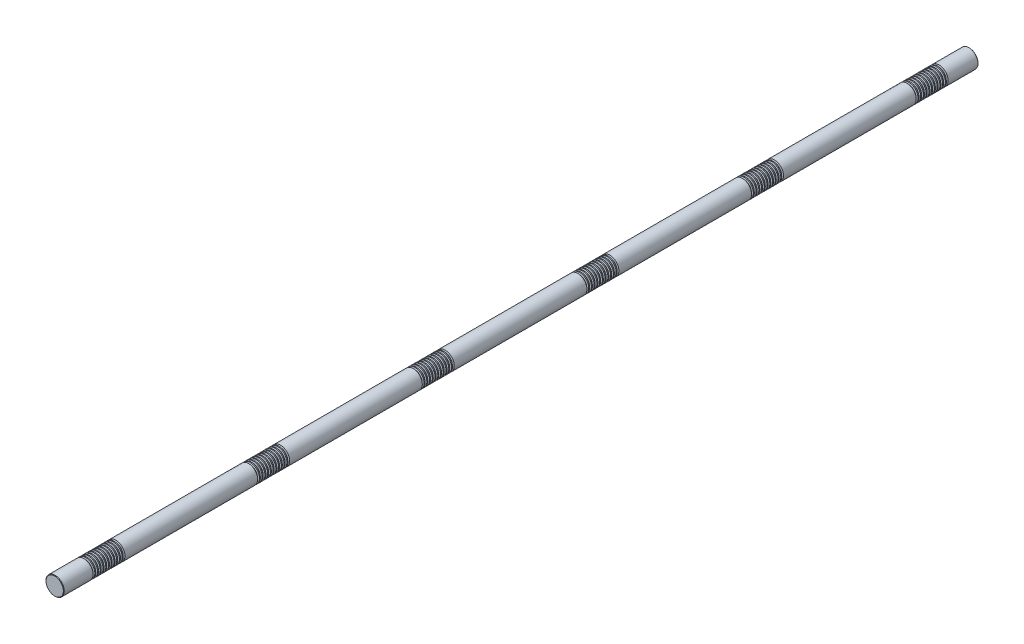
from build123d import *

# Parameters (mm, degrees)
SKETCH1_R           = 30
BOSS_EXTRUDE1_DEPTH = 1500
CHAMFER1_SIZE       = 1.5
LPATTERN1_COUNT     = 12
LPATTERN1_PITCH     = 9
LPATTERN2_COUNT     = 6
LPATTERN2_PITCH     = 540


with BuildPart() as part:
    # Sketch1 → Boss-Extrude1 (new, symmetric)
    with BuildSketch(Plane.XY):
        Circle(SKETCH1_R)
    extrude(amount=BOSS_EXTRUDE1_DEPTH, both=True)

    # Chamfer1
    chamfer1_edges = [part.edges().sort_by_distance(p)[0] for p in [
        (-30, 0, -1500),
        (-30, 0, 1500),
    ]]
    chamfer(chamfer1_edges, length=CHAMFER1_SIZE)

    # Sketch2 → Cut-Revolve1 (revolve, cut)
    with BuildSketch(Plane(origin=(0, 0, 0), x_dir=(0, 0, -1), z_dir=(1, 0, 0)), mode=Mode.PRIVATE) as cut_revolve1_sk:
        Polygon((1400.669872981, 30), (1394.830127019, 30), (1396.169872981, 25), (1399.330127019, 25), align=None)
    cut_revolve1 = revolve(cut_revolve1_sk.sketch.rotate(Axis((0, 0, 1500), (0, 0, -1)), 90), axis=Axis((0, 0, 1500), (0, 0, -1)), mode=Mode.SUBTRACT)

    # LPattern1: Cut-Revolve1 ×12
    with Locations(*[(0, 0, i * LPATTERN1_PITCH) for i in range(1, LPATTERN1_COUNT)]):
        add(cut_revolve1, mode=Mode.SUBTRACT)

    # LPattern2: Cut-Revolve1 ×6
    with Locations(*[(0, 0, i * LPATTERN2_PITCH) for i in range(1, LPATTERN2_COUNT)]):
        add(cut_revolve1, mode=Mode.SUBTRACT)

    # LPattern2 copy 1 sketch → LPattern2 copy 1 (revolve, cut)
    with BuildSketch(Plane(origin=(0, 0, 549), x_dir=(0, 0, -1), z_dir=(1, 0, 0))):
        Polygon((1400.669872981, 30), (1394.830127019, 30), (1396.169872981, 25), (1399.330127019, 25), align=None)
    revolve(axis=Axis((0, 0, 2049), (0, 0, -1)), mode=Mode.SUBTRACT)

    # LPattern2 copy 2 sketch → LPattern2 copy 2 (revolve, cut)
    with BuildSketch(Plane(origin=(0, 0, 1089), x_dir=(0, 0, -1), z_dir=(1, 0, 0))):
        Polygon((1400.669872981, 30), (1394.830127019, 30), (1396.169872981, 25), (1399.330127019, 25), align=None)
    revolve(axis=Axis((0, 0, 2589), (0, 0, -1)), mode=Mode.SUBTRACT)

    # LPattern2 copy 3 sketch → LPattern2 copy 3 (revolve, cut)
    with BuildSketch(Plane(origin=(0, 0, 1629), x_dir=(0, 0, -1), z_dir=(1, 0, 0))):
        Polygon((1400.669872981, 30), (1394.830127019, 30), (1396.169872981, 25), (1399.330127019, 25), align=None)
    revolve(axis=Axis((0, 0, 3129), (0, 0, -1)), mode=Mode.SUBTRACT)

    # LPattern2 copy 4 sketch → LPattern2 copy 4 (revolve, cut)
    with BuildSketch(Plane(origin=(0, 0, 2169), x_dir=(0, 0, -1), z_dir=(1, 0, 0))):
        Polygon((1400.669872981, 30), (1394.830127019, 30), (1396.169872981, 25), (1399.330127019, 25), align=None)
    revolve(axis=Axis((0, 0, 3669), (0, 0, -1)), mode=Mode.SUBTRACT)

    # LPattern2 copy 5 sketch → LPattern2 copy 5 (revolve, cut)
    with BuildSketch(Plane(origin=(0, 0, 2709), x_dir=(0, 0, -1), z_dir=(1, 0, 0))):
        Polygon((1400.669872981, 30), (1394.830127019, 30), (1396.169872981, 25), (1399.330127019, 25), align=None)
    revolve(axis=Axis((0, 0, 4209), (0, 0, -1)), mode=Mode.SUBTRACT)

    # LPattern2 copy 6 sketch → LPattern2 copy 6 (revolve, cut)
    with BuildSketch(Plane(origin=(0, 0, 558), x_dir=(0, 0, -1), z_dir=(1, 0, 0))):
        Polygon((1400.669872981, 30), (1394.830127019, 30), (1396.169872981, 25), (1399.330127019, 25), align=None)
    revolve(axis=Axis((0, 0, 2058), (0, 0, -1)), mode=Mode.SUBTRACT)

    # LPattern2 copy 7 sketch → LPattern2 copy 7 (revolve, cut)
    with BuildSketch(Plane(origin=(0, 0, 1098), x_dir=(0, 0, -1), z_dir=(1, 0, 0))):
        Polygon((1400.669872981, 30), (1394.830127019, 30), (1396.169872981, 25), (1399.330127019, 25), align=None)
    revolve(axis=Axis((0, 0, 2598), (0, 0, -1)), mode=Mode.SUBTRACT)

    # LPattern2 copy 8 sketch → LPattern2 copy 8 (revolve, cut)
    with BuildSketch(Plane(origin=(0, 0, 1638), x_dir=(0, 0, -1), z_dir=(1, 0, 0))):
        Polygon((1400.669872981, 30), (1394.830127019, 30), (1396.169872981, 25), (1399.330127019, 25), align=None)
    revolve(axis=Axis((0, 0, 3138), (0, 0, -1)), mode=Mode.SUBTRACT)

    # LPattern2 copy 9 sketch → LPattern2 copy 9 (revolve, cut)
    with BuildSketch(Plane(origin=(0, 0, 2178), x_dir=(0, 0, -1), z_dir=(1, 0, 0))):
        Polygon((1400.669872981, 30), (1394.830127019, 30), (1396.169872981, 25), (1399.330127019, 25), align=None)
    revolve(axis=Axis((0, 0, 3678), (0, 0, -1)), mode=Mode.SUBTRACT)

    # LPattern2 copy 10 sketch → LPattern2 copy 10 (revolve, cut)
    with BuildSketch(Plane(origin=(0, 0, 2718), x_dir=(0, 0, -1), z_dir=(1, 0, 0))):
        Polygon((1400.669872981, 30), (1394.830127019, 30), (1396.169872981, 25), (1399.330127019, 25), align=None)
    revolve(axis=Axis((0, 0, 4218), (0, 0, -1)), mode=Mode.SUBTRACT)

    # LPattern2 copy 11 sketch → LPattern2 copy 11 (revolve, cut)
    with BuildSketch(Plane(origin=(0, 0, 567), x_dir=(0, 0, -1), z_dir=(1, 0, 0))):
        Polygon((1400.669872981, 30), (1394.830127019, 30), (1396.169872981, 25), (1399.330127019, 25), align=None)
    revolve(axis=Axis((0, 0, 2067), (0, 0, -1)), mode=Mode.SUBTRACT)

    # LPattern2 copy 12 sketch → LPattern2 copy 12 (revolve, cut)
    with BuildSketch(Plane(origin=(0, 0, 1107), x_dir=(0, 0, -1), z_dir=(1, 0, 0))):
        Polygon((1400.669872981, 30), (1394.830127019, 30), (1396.169872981, 25), (1399.330127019, 25), align=None)
    revolve(axis=Axis((0, 0, 2607), (0, 0, -1)), mode=Mode.SUBTRACT)

    # LPattern2 copy 13 sketch → LPattern2 copy 13 (revolve, cut)
    with BuildSketch(Plane(origin=(0, 0, 1647), x_dir=(0, 0, -1), z_dir=(1, 0, 0))):
        Polygon((1400.669872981, 30), (1394.830127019, 30), (1396.169872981, 25), (1399.330127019, 25), align=None)
    revolve(axis=Axis((0, 0, 3147), (0, 0, -1)), mode=Mode.SUBTRACT)

    # LPattern2 copy 14 sketch → LPattern2 copy 14 (revolve, cut)
    with BuildSketch(Plane(origin=(0, 0, 2187), x_dir=(0, 0, -1), z_dir=(1, 0, 0))):
        Polygon((1400.669872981, 30), (1394.830127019, 30), (1396.169872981, 25), (1399.330127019, 25), align=None)
    revolve(axis=Axis((0, 0, 3687), (0, 0, -1)), mode=Mode.SUBTRACT)

    # LPattern2 copy 15 sketch → LPattern2 copy 15 (revolve, cut)
    with BuildSketch(Plane(origin=(0, 0, 2727), x_dir=(0, 0, -1), z_dir=(1, 0, 0))):
        Polygon((1400.669872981, 30), (1394.830127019, 30), (1396.169872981, 25), (1399.330127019, 25), align=None)
    revolve(axis=Axis((0, 0, 4227), (0, 0, -1)), mode=Mode.SUBTRACT)

    # LPattern2 copy 16 sketch → LPattern2 copy 16 (revolve, cut)
    with BuildSketch(Plane(origin=(0, 0, 576), x_dir=(0, 0, -1), z_dir=(1, 0, 0))):
        Polygon((1400.669872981, 30), (1394.830127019, 30), (1396.169872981, 25), (1399.330127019, 25), align=None)
    revolve(axis=Axis((0, 0, 2076), (0, 0, -1)), mode=Mode.SUBTRACT)

    # LPattern2 copy 17 sketch → LPattern2 copy 17 (revolve, cut)
    with BuildSketch(Plane(origin=(0, 0, 1116), x_dir=(0, 0, -1), z_dir=(1, 0, 0))):
        Polygon((1400.669872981, 30), (1394.830127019, 30), (1396.169872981, 25), (1399.330127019, 25), align=None)
    revolve(axis=Axis((0, 0, 2616), (0, 0, -1)), mode=Mode.SUBTRACT)

    # LPattern2 copy 18 sketch → LPattern2 copy 18 (revolve, cut)
    with BuildSketch(Plane(origin=(0, 0, 1656), x_dir=(0, 0, -1), z_dir=(1, 0, 0))):
        Polygon((1400.669872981, 30), (1394.830127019, 30), (1396.169872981, 25), (1399.330127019, 25), align=None)
    revolve(axis=Axis((0, 0, 3156), (0, 0, -1)), mode=Mode.SUBTRACT)

    # LPattern2 copy 19 sketch → LPattern2 copy 19 (revolve, cut)
    with BuildSketch(Plane(origin=(0, 0, 2196), x_dir=(0, 0, -1), z_dir=(1, 0, 0))):
        Polygon((1400.669872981, 30), (1394.830127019, 30), (1396.169872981, 25), (1399.330127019, 25), align=None)
    revolve(axis=Axis((0, 0, 3696), (0, 0, -1)), mode=Mode.SUBTRACT)

    # LPattern2 copy 20 sketch → LPattern2 copy 20 (revolve, cut)
    with BuildSketch(Plane(origin=(0, 0, 2736), x_dir=(0, 0, -1), z_dir=(1, 0, 0))):
        Polygon((1400.669872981, 30), (1394.830127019, 30), (1396.169872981, 25), (1399.330127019, 25), align=None)
    revolve(axis=Axis((0, 0, 4236), (0, 0, -1)), mode=Mode.SUBTRACT)

    # LPattern2 copy 21 sketch → LPattern2 copy 21 (revolve, cut)
    with BuildSketch(Plane(origin=(0, 0, 585), x_dir=(0, 0, -1), z_dir=(1, 0, 0))):
        Polygon((1400.669872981, 30), (1394.830127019, 30), (1396.169872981, 25), (1399.330127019, 25), align=None)
    revolve(axis=Axis((0, 0, 2085), (0, 0, -1)), mode=Mode.SUBTRACT)

    # LPattern2 copy 22 sketch → LPattern2 copy 22 (revolve, cut)
    with BuildSketch(Plane(origin=(0, 0, 1125), x_dir=(0, 0, -1), z_dir=(1, 0, 0))):
        Polygon((1400.669872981, 30), (1394.830127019, 30), (1396.169872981, 25), (1399.330127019, 25), align=None)
    revolve(axis=Axis((0, 0, 2625), (0, 0, -1)), mode=Mode.SUBTRACT)

    # LPattern2 copy 23 sketch → LPattern2 copy 23 (revolve, cut)
    with BuildSketch(Plane(origin=(0, 0, 1665), x_dir=(0, 0, -1), z_dir=(1, 0, 0))):
        Polygon((1400.669872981, 30), (1394.830127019, 30), (1396.169872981, 25), (1399.330127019, 25), align=None)
    revolve(axis=Axis((0, 0, 3165), (0, 0, -1)), mode=Mode.SUBTRACT)

    # LPattern2 copy 24 sketch → LPattern2 copy 24 (revolve, cut)
    with BuildSketch(Plane(origin=(0, 0, 2205), x_dir=(0, 0, -1), z_dir=(1, 0, 0))):
        Polygon((1400.669872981, 30), (1394.830127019, 30), (1396.169872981, 25), (1399.330127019, 25), align=None)
    revolve(axis=Axis((0, 0, 3705), (0, 0, -1)), mode=Mode.SUBTRACT)

    # LPattern2 copy 25 sketch → LPattern2 copy 25 (revolve, cut)
    with BuildSketch(Plane(origin=(0, 0, 2745), x_dir=(0, 0, -1), z_dir=(1, 0, 0))):
        Polygon((1400.669872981, 30), (1394.830127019, 30), (1396.169872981, 25), (1399.330127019, 25), align=None)
    revolve(axis=Axis((0, 0, 4245), (0, 0, -1)), mode=Mode.SUBTRACT)

    # LPattern2 copy 26 sketch → LPattern2 copy 26 (revolve, cut)
    with BuildSketch(Plane(origin=(0, 0, 594), x_dir=(0, 0, -1), z_dir=(1, 0, 0))):
        Polygon((1400.669872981, 30), (1394.830127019, 30), (1396.169872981, 25), (1399.330127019, 25), align=None)
    revolve(axis=Axis((0, 0, 2094), (0, 0, -1)), mode=Mode.SUBTRACT)

    # LPattern2 copy 27 sketch → LPattern2 copy 27 (revolve, cut)
    with BuildSketch(Plane(origin=(0, 0, 1134), x_dir=(0, 0, -1), z_dir=(1, 0, 0))):
        Polygon((1400.669872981, 30), (1394.830127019, 30), (1396.169872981, 25), (1399.330127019, 25), align=None)
    revolve(axis=Axis((0, 0, 2634), (0, 0, -1)), mode=Mode.SUBTRACT)

    # LPattern2 copy 28 sketch → LPattern2 copy 28 (revolve, cut)
    with BuildSketch(Plane(origin=(0, 0, 1674), x_dir=(0, 0, -1), z_dir=(1, 0, 0))):
        Polygon((1400.669872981, 30), (1394.830127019, 30), (1396.169872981, 25), (1399.330127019, 25), align=None)
    revolve(axis=Axis((0, 0, 3174), (0, 0, -1)), mode=Mode.SUBTRACT)

    # LPattern2 copy 29 sketch → LPattern2 copy 29 (revolve, cut)
    with BuildSketch(Plane(origin=(0, 0, 2214), x_dir=(0, 0, -1), z_dir=(1, 0, 0))):
        Polygon((1400.669872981, 30), (1394.830127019, 30), (1396.169872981, 25), (1399.330127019, 25), align=None)
    revolve(axis=Axis((0, 0, 3714), (0, 0, -1)), mode=Mode.SUBTRACT)

    # LPattern2 copy 30 sketch → LPattern2 copy 30 (revolve, cut)
    with BuildSketch(Plane(origin=(0, 0, 2754), x_dir=(0, 0, -1), z_dir=(1, 0, 0))):
        Polygon((1400.669872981, 30), (1394.830127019, 30), (1396.169872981, 25), (1399.330127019, 25), align=None)
    revolve(axis=Axis((0, 0, 4254), (0, 0, -1)), mode=Mode.SUBTRACT)

    # LPattern2 copy 31 sketch → LPattern2 copy 31 (revolve, cut)
    with BuildSketch(Plane(origin=(0, 0, 603), x_dir=(0, 0, -1), z_dir=(1, 0, 0))):
        Polygon((1400.669872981, 30), (1394.830127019, 30), (1396.169872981, 25), (1399.330127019, 25), align=None)
    revolve(axis=Axis((0, 0, 2103), (0, 0, -1)), mode=Mode.SUBTRACT)

    # LPattern2 copy 32 sketch → LPattern2 copy 32 (revolve, cut)
    with BuildSketch(Plane(origin=(0, 0, 1143), x_dir=(0, 0, -1), z_dir=(1, 0, 0))):
        Polygon((1400.669872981, 30), (1394.830127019, 30), (1396.169872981, 25), (1399.330127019, 25), align=None)
    revolve(axis=Axis((0, 0, 2643), (0, 0, -1)), mode=Mode.SUBTRACT)

    # LPattern2 copy 33 sketch → LPattern2 copy 33 (revolve, cut)
    with BuildSketch(Plane(origin=(0, 0, 1683), x_dir=(0, 0, -1), z_dir=(1, 0, 0))):
        Polygon((1400.669872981, 30), (1394.830127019, 30), (1396.169872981, 25), (1399.330127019, 25), align=None)
    revolve(axis=Axis((0, 0, 3183), (0, 0, -1)), mode=Mode.SUBTRACT)

    # LPattern2 copy 34 sketch → LPattern2 copy 34 (revolve, cut)
    with BuildSketch(Plane(origin=(0, 0, 2223), x_dir=(0, 0, -1), z_dir=(1, 0, 0))):
        Polygon((1400.669872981, 30), (1394.830127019, 30), (1396.169872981, 25), (1399.330127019, 25), align=None)
    revolve(axis=Axis((0, 0, 3723), (0, 0, -1)), mode=Mode.SUBTRACT)

    # LPattern2 copy 35 sketch → LPattern2 copy 35 (revolve, cut)
    with BuildSketch(Plane(origin=(0, 0, 2763), x_dir=(0, 0, -1), z_dir=(1, 0, 0))):
        Polygon((1400.669872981, 30), (1394.830127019, 30), (1396.169872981, 25), (1399.330127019, 25), align=None)
    revolve(axis=Axis((0, 0, 4263), (0, 0, -1)), mode=Mode.SUBTRACT)

    # LPattern2 copy 36 sketch → LPattern2 copy 36 (revolve, cut)
    with BuildSketch(Plane(origin=(0, 0, 612), x_dir=(0, 0, -1), z_dir=(1, 0, 0))):
        Polygon((1400.669872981, 30), (1394.830127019, 30), (1396.169872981, 25), (1399.330127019, 25), align=None)
    revolve(axis=Axis((0, 0, 2112), (0, 0, -1)), mode=Mode.SUBTRACT)

    # LPattern2 copy 37 sketch → LPattern2 copy 37 (revolve, cut)
    with BuildSketch(Plane(origin=(0, 0, 1152), x_dir=(0, 0, -1), z_dir=(1, 0, 0))):
        Polygon((1400.669872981, 30), (1394.830127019, 30), (1396.169872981, 25), (1399.330127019, 25), align=None)
    revolve(axis=Axis((0, 0, 2652), (0, 0, -1)), mode=Mode.SUBTRACT)

    # LPattern2 copy 38 sketch → LPattern2 copy 38 (revolve, cut)
    with BuildSketch(Plane(origin=(0, 0, 1692), x_dir=(0, 0, -1), z_dir=(1, 0, 0))):
        Polygon((1400.669872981, 30), (1394.830127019, 30), (1396.169872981, 25), (1399.330127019, 25), align=None)
    revolve(axis=Axis((0, 0, 3192), (0, 0, -1)), mode=Mode.SUBTRACT)

    # LPattern2 copy 39 sketch → LPattern2 copy 39 (revolve, cut)
    with BuildSketch(Plane(origin=(0, 0, 2232), x_dir=(0, 0, -1), z_dir=(1, 0, 0))):
        Polygon((1400.669872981, 30), (1394.830127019, 30), (1396.169872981, 25), (1399.330127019, 25), align=None)
    revolve(axis=Axis((0, 0, 3732), (0, 0, -1)), mode=Mode.SUBTRACT)

    # LPattern2 copy 40 sketch → LPattern2 copy 40 (revolve, cut)
    with BuildSketch(Plane(origin=(0, 0, 2772), x_dir=(0, 0, -1), z_dir=(1, 0, 0))):
        Polygon((1400.669872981, 30), (1394.830127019, 30), (1396.169872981, 25), (1399.330127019, 25), align=None)
    revolve(axis=Axis((0, 0, 4272), (0, 0, -1)), mode=Mode.SUBTRACT)

    # LPattern2 copy 41 sketch → LPattern2 copy 41 (revolve, cut)
    with BuildSketch(Plane(origin=(0, 0, 621), x_dir=(0, 0, -1), z_dir=(1, 0, 0))):
        Polygon((1400.669872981, 30), (1394.830127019, 30), (1396.169872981, 25), (1399.330127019, 25), align=None)
    revolve(axis=Axis((0, 0, 2121), (0, 0, -1)), mode=Mode.SUBTRACT)

    # LPattern2 copy 42 sketch → LPattern2 copy 42 (revolve, cut)
    with BuildSketch(Plane(origin=(0, 0, 1161), x_dir=(0, 0, -1), z_dir=(1, 0, 0))):
        Polygon((1400.669872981, 30), (1394.830127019, 30), (1396.169872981, 25), (1399.330127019, 25), align=None)
    revolve(axis=Axis((0, 0, 2661), (0, 0, -1)), mode=Mode.SUBTRACT)

    # LPattern2 copy 43 sketch → LPattern2 copy 43 (revolve, cut)
    with BuildSketch(Plane(origin=(0, 0, 1701), x_dir=(0, 0, -1), z_dir=(1, 0, 0))):
        Polygon((1400.669872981, 30), (1394.830127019, 30), (1396.169872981, 25), (1399.330127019, 25), align=None)
    revolve(axis=Axis((0, 0, 3201), (0, 0, -1)), mode=Mode.SUBTRACT)

    # LPattern2 copy 44 sketch → LPattern2 copy 44 (revolve, cut)
    with BuildSketch(Plane(origin=(0, 0, 2241), x_dir=(0, 0, -1), z_dir=(1, 0, 0))):
        Polygon((1400.669872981, 30), (1394.830127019, 30), (1396.169872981, 25), (1399.330127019, 25), align=None)
    revolve(axis=Axis((0, 0, 3741), (0, 0, -1)), mode=Mode.SUBTRACT)

    # LPattern2 copy 45 sketch → LPattern2 copy 45 (revolve, cut)
    with BuildSketch(Plane(origin=(0, 0, 2781), x_dir=(0, 0, -1), z_dir=(1, 0, 0))):
        Polygon((1400.669872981, 30), (1394.830127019, 30), (1396.169872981, 25), (1399.330127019, 25), align=None)
    revolve(axis=Axis((0, 0, 4281), (0, 0, -1)), mode=Mode.SUBTRACT)

    # LPattern2 copy 46 sketch → LPattern2 copy 46 (revolve, cut)
    with BuildSketch(Plane(origin=(0, 0, 630), x_dir=(0, 0, -1), z_dir=(1, 0, 0))):
        Polygon((1400.669872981, 30), (1394.830127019, 30), (1396.169872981, 25), (1399.330127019, 25), align=None)
    revolve(axis=Axis((0, 0, 2130), (0, 0, -1)), mode=Mode.SUBTRACT)

    # LPattern2 copy 47 sketch → LPattern2 copy 47 (revolve, cut)
    with BuildSketch(Plane(origin=(0, 0, 1170), x_dir=(0, 0, -1), z_dir=(1, 0, 0))):
        Polygon((1400.669872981, 30), (1394.830127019, 30), (1396.169872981, 25), (1399.330127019, 25), align=None)
    revolve(axis=Axis((0, 0, 2670), (0, 0, -1)), mode=Mode.SUBTRACT)

    # LPattern2 copy 48 sketch → LPattern2 copy 48 (revolve, cut)
    with BuildSketch(Plane(origin=(0, 0, 1710), x_dir=(0, 0, -1), z_dir=(1, 0, 0))):
        Polygon((1400.669872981, 30), (1394.830127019, 30), (1396.169872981, 25), (1399.330127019, 25), align=None)
    revolve(axis=Axis((0, 0, 3210), (0, 0, -1)), mode=Mode.SUBTRACT)

    # LPattern2 copy 49 sketch → LPattern2 copy 49 (revolve, cut)
    with BuildSketch(Plane(origin=(0, 0, 2250), x_dir=(0, 0, -1), z_dir=(1, 0, 0))):
        Polygon((1400.669872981, 30), (1394.830127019, 30), (1396.169872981, 25), (1399.330127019, 25), align=None)
    revolve(axis=Axis((0, 0, 3750), (0, 0, -1)), mode=Mode.SUBTRACT)

    # LPattern2 copy 50 sketch → LPattern2 copy 50 (revolve, cut)
    with BuildSketch(Plane(origin=(0, 0, 2790), x_dir=(0, 0, -1), z_dir=(1, 0, 0))):
        Polygon((1400.669872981, 30), (1394.830127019, 30), (1396.169872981, 25), (1399.330127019, 25), align=None)
    revolve(axis=Axis((0, 0, 4290), (0, 0, -1)), mode=Mode.SUBTRACT)

    # LPattern2 copy 51 sketch → LPattern2 copy 51 (revolve, cut)
    with BuildSketch(Plane(origin=(0, 0, 639), x_dir=(0, 0, -1), z_dir=(1, 0, 0))):
        Polygon((1400.669872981, 30), (1394.830127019, 30), (1396.169872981, 25), (1399.330127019, 25), align=None)
    revolve(axis=Axis((0, 0, 2139), (0, 0, -1)), mode=Mode.SUBTRACT)

    # LPattern2 copy 52 sketch → LPattern2 copy 52 (revolve, cut)
    with BuildSketch(Plane(origin=(0, 0, 1179), x_dir=(0, 0, -1), z_dir=(1, 0, 0))):
        Polygon((1400.669872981, 30), (1394.830127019, 30), (1396.169872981, 25), (1399.330127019, 25), align=None)
    revolve(axis=Axis((0, 0, 2679), (0, 0, -1)), mode=Mode.SUBTRACT)

    # LPattern2 copy 53 sketch → LPattern2 copy 53 (revolve, cut)
    with BuildSketch(Plane(origin=(0, 0, 1719), x_dir=(0, 0, -1), z_dir=(1, 0, 0))):
        Polygon((1400.669872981, 30), (1394.830127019, 30), (1396.169872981, 25), (1399.330127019, 25), align=None)
    revolve(axis=Axis((0, 0, 3219), (0, 0, -1)), mode=Mode.SUBTRACT)

    # LPattern2 copy 54 sketch → LPattern2 copy 54 (revolve, cut)
    with BuildSketch(Plane(origin=(0, 0, 2259), x_dir=(0, 0, -1), z_dir=(1, 0, 0))):
        Polygon((1400.669872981, 30), (1394.830127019, 30), (1396.169872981, 25), (1399.330127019, 25), align=None)
    revolve(axis=Axis((0, 0, 3759), (0, 0, -1)), mode=Mode.SUBTRACT)

    # LPattern2 copy 55 sketch → LPattern2 copy 55 (revolve, cut)
    with BuildSketch(Plane(origin=(0, 0, 2799), x_dir=(0, 0, -1), z_dir=(1, 0, 0))):
        Polygon((1400.669872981, 30), (1394.830127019, 30), (1396.169872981, 25), (1399.330127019, 25), align=None)
    revolve(axis=Axis((0, 0, 4299), (0, 0, -1)), mode=Mode.SUBTRACT)


solid = part.part
